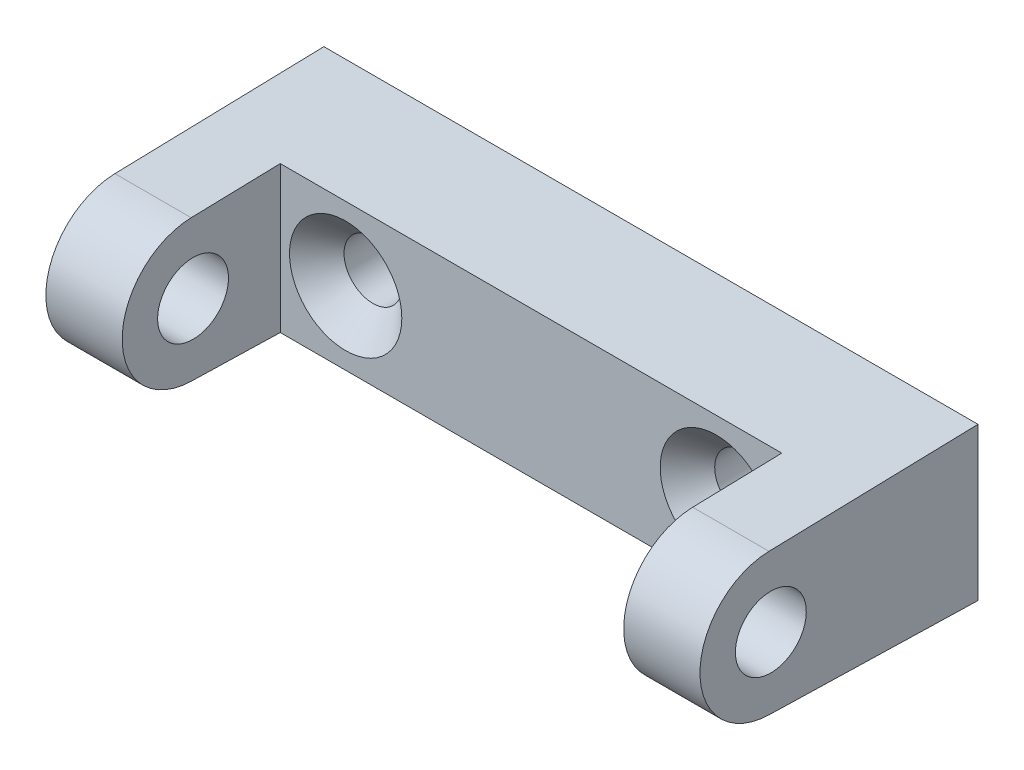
ISO-10303-21;
HEADER;
FILE_DESCRIPTION(('STEP AP214'),'2;1');
FILE_NAME('part.step','',(''),(''),'','','');
FILE_SCHEMA(('AUTOMOTIVE_DESIGN { 1 0 10303 214 1 1 1 1 }'));
ENDSEC;
DATA;
#1=APPLICATION_CONTEXT('core data for automotive mechanical design processes');
#2=APPLICATION_PROTOCOL_DEFINITION('international standard','automotive_design',2000,#1);
#3=PRODUCT_CONTEXT('',#1,'mechanical');
#4=PRODUCT('Part','Part','',(#3));
#5=PRODUCT_RELATED_PRODUCT_CATEGORY('part','',(#4));
#6=PRODUCT_DEFINITION_FORMATION('','',#4);
#7=PRODUCT_DEFINITION_CONTEXT('part definition',#1,'design');
#8=PRODUCT_DEFINITION('design','',#6,#7);
#9=PRODUCT_DEFINITION_SHAPE('','',#8);
#10=(LENGTH_UNIT() NAMED_UNIT(*) SI_UNIT(.MILLI.,.METRE.));
#11=(NAMED_UNIT(*) PLANE_ANGLE_UNIT() SI_UNIT($,.RADIAN.));
#12=(NAMED_UNIT(*) SI_UNIT($,.STERADIAN.) SOLID_ANGLE_UNIT());
#13=UNCERTAINTY_MEASURE_WITH_UNIT(LENGTH_MEASURE(1.E-05),#10,'distance_accuracy_value','');
#14=(GEOMETRIC_REPRESENTATION_CONTEXT(3) GLOBAL_UNCERTAINTY_ASSIGNED_CONTEXT((#13)) GLOBAL_UNIT_ASSIGNED_CONTEXT((#10,
#11,#12)) REPRESENTATION_CONTEXT('',''));
#15=CARTESIAN_POINT('',(0.,0.,0.));
#16=DIRECTION('',(0.,0.,1.));
#17=DIRECTION('',(1.,0.,0.));
#18=AXIS2_PLACEMENT_3D('',#15,#16,#17);
#19=CARTESIAN_POINT('',(34.,0.,18.4953318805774));
#20=DIRECTION('',(0.,0.,-1.));
#21=DIRECTION('',(-1.,0.,0.));
#22=AXIS2_PLACEMENT_3D('',#19,#20,#21);
#23=CYLINDRICAL_SURFACE('',#22,2.65);
#24=CARTESIAN_POINT('',(34.,0.,0.));
#25=DIRECTION('',(0.,0.,-1.));
#26=DIRECTION('',(-1.,0.,0.));
#27=AXIS2_PLACEMENT_3D('',#24,#25,#26);
#28=CIRCLE('',#27,2.65);
#29=CARTESIAN_POINT('',(31.35,0.,0.));
#30=VERTEX_POINT('',#29);
#31=EDGE_CURVE('E104',#30,#30,#28,.T.);
#32=ORIENTED_EDGE('',*,*,#31,.T.);
#33=EDGE_LOOP('',(#32));
#34=FACE_BOUND('',#33,.T.);
#35=CARTESIAN_POINT('',(34.,0.,8.5));
#36=DIRECTION('',(0.,0.,1.));
#37=DIRECTION('',(1.,0.,0.));
#38=AXIS2_PLACEMENT_3D('',#35,#36,#37);
#39=CIRCLE('',#38,2.65);
#40=CARTESIAN_POINT('',(36.65,0.,8.5));
#41=VERTEX_POINT('',#40);
#42=EDGE_CURVE('E337',#41,#41,#39,.T.);
#43=ORIENTED_EDGE('',*,*,#42,.T.);
#44=EDGE_LOOP('',(#43));
#45=FACE_BOUND('',#44,.T.);
#46=ADVANCED_FACE('F14',(#34,#45),#23,.F.);
#47=CARTESIAN_POINT('',(0.,0.,18.4953318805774));
#48=DIRECTION('',(0.,0.,-1.));
#49=DIRECTION('',(-1.,0.,0.));
#50=AXIS2_PLACEMENT_3D('',#47,#48,#49);
#51=CYLINDRICAL_SURFACE('',#50,2.65);
#52=CARTESIAN_POINT('',(0.,0.,0.));
#53=DIRECTION('',(0.,0.,-1.));
#54=DIRECTION('',(-1.,0.,0.));
#55=AXIS2_PLACEMENT_3D('',#52,#53,#54);
#56=CIRCLE('',#55,2.65);
#57=CARTESIAN_POINT('',(-2.65,0.,0.));
#58=VERTEX_POINT('',#57);
#59=EDGE_CURVE('E100',#58,#58,#56,.T.);
#60=ORIENTED_EDGE('',*,*,#59,.T.);
#61=EDGE_LOOP('',(#60));
#62=FACE_BOUND('',#61,.T.);
#63=CARTESIAN_POINT('',(0.,0.,8.5));
#64=DIRECTION('',(0.,0.,1.));
#65=DIRECTION('',(1.,0.,0.));
#66=AXIS2_PLACEMENT_3D('',#63,#64,#65);
#67=CIRCLE('',#66,2.65);
#68=CARTESIAN_POINT('',(2.65,0.,8.5));
#69=VERTEX_POINT('',#68);
#70=EDGE_CURVE('E341',#69,#69,#67,.T.);
#71=ORIENTED_EDGE('',*,*,#70,.T.);
#72=EDGE_LOOP('',(#71));
#73=FACE_BOUND('',#72,.T.);
#74=ADVANCED_FACE('F190',(#62,#73),#51,.F.);
#75=CARTESIAN_POINT('',(47.,0.,19.));
#76=DIRECTION('',(1.,0.,0.));
#77=DIRECTION('',(0.,1.,0.));
#78=AXIS2_PLACEMENT_3D('',#75,#76,#77);
#79=PLANE('',#78);
#80=DIRECTION('',(0.,1.,0.));
#81=VECTOR('',#80,1.);
#82=CARTESIAN_POINT('',(47.,-7.,0.));
#83=LINE('',#82,#81);
#84=CARTESIAN_POINT('',(47.,-7.,0.));
#85=VERTEX_POINT('',#84);
#86=CARTESIAN_POINT('',(47.,7.,0.));
#87=VERTEX_POINT('',#86);
#88=EDGE_CURVE('E141',#85,#87,#83,.T.);
#89=ORIENTED_EDGE('',*,*,#88,.T.);
#90=DIRECTION('',(0.,-0.0261894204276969,0.999656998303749));
#91=VECTOR('',#90,1.);
#92=CARTESIAN_POINT('',(47.,7.,0.));
#93=LINE('',#92,#91);
#94=CARTESIAN_POINT('',(47.,6.49777048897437,19.1702312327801));
#95=VERTEX_POINT('',#94);
#96=EDGE_CURVE('E144',#87,#95,#93,.T.);
#97=ORIENTED_EDGE('',*,*,#96,.T.);
#98=CARTESIAN_POINT('',(47.,0.,19.));
#99=DIRECTION('',(1.,0.,0.));
#100=DIRECTION('',(0.,1.,0.));
#101=AXIS2_PLACEMENT_3D('',#98,#99,#100);
#102=CIRCLE('',#101,6.5);
#103=CARTESIAN_POINT('',(47.,-6.49777048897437,19.1702312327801));
#104=VERTEX_POINT('',#103);
#105=EDGE_CURVE('E147',#95,#104,#102,.T.);
#106=ORIENTED_EDGE('',*,*,#105,.T.);
#107=DIRECTION('',(0.,0.0261894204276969,0.999656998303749));
#108=VECTOR('',#107,1.);
#109=CARTESIAN_POINT('',(47.,-7.,0.));
#110=LINE('',#109,#108);
#111=EDGE_CURVE('E149',#85,#104,#110,.T.);
#112=ORIENTED_EDGE('',*,*,#111,.F.);
#113=EDGE_LOOP('',(#89,#97,#106,#112));
#114=FACE_BOUND('',#113,.T.);
#115=CARTESIAN_POINT('',(47.,0.,19.));
#116=DIRECTION('',(1.,0.,0.));
#117=DIRECTION('',(0.,1.,0.));
#118=AXIS2_PLACEMENT_3D('',#115,#116,#117);
#119=CIRCLE('',#118,3.25);
#120=CARTESIAN_POINT('',(47.,3.25,19.));
#121=VERTEX_POINT('',#120);
#122=EDGE_CURVE('E118',#121,#121,#119,.T.);
#123=ORIENTED_EDGE('',*,*,#122,.F.);
#124=EDGE_LOOP('',(#123));
#125=FACE_BOUND('',#124,.T.);
#126=ADVANCED_FACE('F177',(#114,#125),#79,.T.);
#127=CARTESIAN_POINT('',(-13.,0.,19.));
#128=DIRECTION('',(1.,0.,0.));
#129=DIRECTION('',(0.,1.,0.));
#130=AXIS2_PLACEMENT_3D('',#127,#128,#129);
#131=PLANE('',#130);
#132=DIRECTION('',(0.,1.,0.));
#133=VECTOR('',#132,1.);
#134=CARTESIAN_POINT('',(-13.,-7.,0.));
#135=LINE('',#134,#133);
#136=CARTESIAN_POINT('',(-13.,-7.,0.));
#137=VERTEX_POINT('',#136);
#138=CARTESIAN_POINT('',(-13.,7.,0.));
#139=VERTEX_POINT('',#138);
#140=EDGE_CURVE('E129',#137,#139,#135,.T.);
#141=ORIENTED_EDGE('',*,*,#140,.F.);
#142=DIRECTION('',(0.,0.0261894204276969,0.999656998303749));
#143=VECTOR('',#142,1.);
#144=CARTESIAN_POINT('',(-13.,-7.,0.));
#145=LINE('',#144,#143);
#146=CARTESIAN_POINT('',(-13.,-6.49777048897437,19.1702312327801));
#147=VERTEX_POINT('',#146);
#148=EDGE_CURVE('E138',#137,#147,#145,.T.);
#149=ORIENTED_EDGE('',*,*,#148,.T.);
#150=CARTESIAN_POINT('',(-13.,0.,19.));
#151=DIRECTION('',(1.,0.,0.));
#152=DIRECTION('',(0.,1.,0.));
#153=AXIS2_PLACEMENT_3D('',#150,#151,#152);
#154=CIRCLE('',#153,6.5);
#155=CARTESIAN_POINT('',(-13.,6.49777048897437,19.1702312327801));
#156=VERTEX_POINT('',#155);
#157=EDGE_CURVE('E135',#156,#147,#154,.T.);
#158=ORIENTED_EDGE('',*,*,#157,.F.);
#159=DIRECTION('',(0.,-0.0261894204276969,0.999656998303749));
#160=VECTOR('',#159,1.);
#161=CARTESIAN_POINT('',(-13.,7.,0.));
#162=LINE('',#161,#160);
#163=EDGE_CURVE('E132',#139,#156,#162,.T.);
#164=ORIENTED_EDGE('',*,*,#163,.F.);
#165=EDGE_LOOP('',(#141,#149,#158,#164));
#166=FACE_BOUND('',#165,.T.);
#167=CARTESIAN_POINT('',(-13.,0.,19.));
#168=DIRECTION('',(1.,0.,0.));
#169=DIRECTION('',(0.,1.,0.));
#170=AXIS2_PLACEMENT_3D('',#167,#168,#169);
#171=CIRCLE('',#170,3.25);
#172=CARTESIAN_POINT('',(-13.,3.25,19.));
#173=VERTEX_POINT('',#172);
#174=EDGE_CURVE('E115',#173,#173,#171,.T.);
#175=ORIENTED_EDGE('',*,*,#174,.T.);
#176=EDGE_LOOP('',(#175));
#177=FACE_BOUND('',#176,.T.);
#178=ADVANCED_FACE('F170',(#166,#177),#131,.F.);
#179=CARTESIAN_POINT('',(40.,-7.30930116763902,11.8061061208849));
#180=DIRECTION('',(-1.,0.,0.));
#181=DIRECTION('',(0.,-1.,0.));
#182=AXIS2_PLACEMENT_3D('',#179,#180,#181);
#183=PLANE('',#182);
#184=CARTESIAN_POINT('',(40.,0.,19.));
#185=DIRECTION('',(-1.,0.,0.));
#186=DIRECTION('',(0.,-1.,0.));
#187=AXIS2_PLACEMENT_3D('',#184,#185,#186);
#188=CIRCLE('',#187,6.5);
#189=CARTESIAN_POINT('',(40.,-6.49777048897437,19.1702312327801));
#190=VERTEX_POINT('',#189);
#191=CARTESIAN_POINT('',(40.,6.49777048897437,19.1702312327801));
#192=VERTEX_POINT('',#191);
#193=EDGE_CURVE('E127',#190,#192,#188,.T.);
#194=ORIENTED_EDGE('',*,*,#193,.T.);
#195=DIRECTION('',(0.,-0.0261894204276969,0.999656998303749));
#196=VECTOR('',#195,1.);
#197=CARTESIAN_POINT('',(40.,6.68109643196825,12.1726322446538));
#198=LINE('',#197,#196);
#199=CARTESIAN_POINT('',(40.,6.71181752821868,11.));
#200=VERTEX_POINT('',#199);
#201=EDGE_CURVE('E99',#200,#192,#198,.T.);
#202=ORIENTED_EDGE('',*,*,#201,.F.);
#203=DIRECTION('',(0.,1.,0.));
#204=VECTOR('',#203,1.);
#205=CARTESIAN_POINT('',(40.,-10.,11.));
#206=LINE('',#205,#204);
#207=CARTESIAN_POINT('',(40.,-6.71181752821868,11.));
#208=VERTEX_POINT('',#207);
#209=EDGE_CURVE('E91',#208,#200,#206,.T.);
#210=ORIENTED_EDGE('',*,*,#209,.F.);
#211=DIRECTION('',(0.,-0.0261894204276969,-0.999656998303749));
#212=VECTOR('',#211,1.);
#213=CARTESIAN_POINT('',(40.,-7.,0.));
#214=LINE('',#213,#212);
#215=EDGE_CURVE('E9',#190,#208,#214,.T.);
#216=ORIENTED_EDGE('',*,*,#215,.F.);
#217=EDGE_LOOP('',(#194,#202,#210,#216));
#218=FACE_BOUND('',#217,.T.);
#219=CARTESIAN_POINT('',(40.,0.,19.));
#220=DIRECTION('',(-1.,0.,0.));
#221=DIRECTION('',(0.,-1.,0.));
#222=AXIS2_PLACEMENT_3D('',#219,#220,#221);
#223=CIRCLE('',#222,3.25);
#224=CARTESIAN_POINT('',(40.,-3.25,19.));
#225=VERTEX_POINT('',#224);
#226=EDGE_CURVE('E112',#225,#225,#223,.T.);
#227=ORIENTED_EDGE('',*,*,#226,.F.);
#228=EDGE_LOOP('',(#227));
#229=FACE_BOUND('',#228,.T.);
#230=ADVANCED_FACE('F97',(#218,#229),#183,.T.);
#231=CARTESIAN_POINT('',(-6.,-7.30930116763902,11.8061061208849));
#232=DIRECTION('',(-1.,0.,0.));
#233=DIRECTION('',(0.,-1.,0.));
#234=AXIS2_PLACEMENT_3D('',#231,#232,#233);
#235=PLANE('',#234);
#236=DIRECTION('',(0.,-0.0261894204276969,-0.999656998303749));
#237=VECTOR('',#236,1.);
#238=CARTESIAN_POINT('',(-6.,-7.,0.));
#239=LINE('',#238,#237);
#240=CARTESIAN_POINT('',(-6.,-6.49777048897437,19.1702312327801));
#241=VERTEX_POINT('',#240);
#242=CARTESIAN_POINT('',(-6.,-6.71181752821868,11.));
#243=VERTEX_POINT('',#242);
#244=EDGE_CURVE('E22',#241,#243,#239,.T.);
#245=ORIENTED_EDGE('',*,*,#244,.T.);
#246=DIRECTION('',(0.,1.,0.));
#247=VECTOR('',#246,1.);
#248=CARTESIAN_POINT('',(-6.,-10.,11.));
#249=LINE('',#248,#247);
#250=CARTESIAN_POINT('',(-6.,6.71181752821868,11.));
#251=VERTEX_POINT('',#250);
#252=EDGE_CURVE('E94',#243,#251,#249,.T.);
#253=ORIENTED_EDGE('',*,*,#252,.T.);
#254=DIRECTION('',(0.,-0.0261894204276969,0.999656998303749));
#255=VECTOR('',#254,1.);
#256=CARTESIAN_POINT('',(-6.,6.68109643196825,12.1726322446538));
#257=LINE('',#256,#255);
#258=CARTESIAN_POINT('',(-6.,6.49777048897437,19.1702312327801));
#259=VERTEX_POINT('',#258);
#260=EDGE_CURVE('E122',#251,#259,#257,.T.);
#261=ORIENTED_EDGE('',*,*,#260,.T.);
#262=CARTESIAN_POINT('',(-6.,0.,19.));
#263=DIRECTION('',(-1.,0.,0.));
#264=DIRECTION('',(0.,-1.,0.));
#265=AXIS2_PLACEMENT_3D('',#262,#263,#264);
#266=CIRCLE('',#265,6.5);
#267=EDGE_CURVE('E124',#241,#259,#266,.T.);
#268=ORIENTED_EDGE('',*,*,#267,.F.);
#269=EDGE_LOOP('',(#245,#253,#261,#268));
#270=FACE_BOUND('',#269,.T.);
#271=CARTESIAN_POINT('',(-6.,0.,19.));
#272=DIRECTION('',(-1.,0.,0.));
#273=DIRECTION('',(0.,-1.,0.));
#274=AXIS2_PLACEMENT_3D('',#271,#272,#273);
#275=CIRCLE('',#274,3.25);
#276=CARTESIAN_POINT('',(-6.,-3.25,19.));
#277=VERTEX_POINT('',#276);
#278=EDGE_CURVE('E109',#277,#277,#275,.T.);
#279=ORIENTED_EDGE('',*,*,#278,.T.);
#280=EDGE_LOOP('',(#279));
#281=FACE_BOUND('',#280,.T.);
#282=ADVANCED_FACE('F160',(#270,#281),#235,.F.);
#283=CARTESIAN_POINT('',(47.,7.,0.));
#284=DIRECTION('',(0.,-0.999656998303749,-0.0261894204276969));
#285=DIRECTION('',(0.,0.0261894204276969,-0.999656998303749));
#286=AXIS2_PLACEMENT_3D('',#283,#284,#285);
#287=PLANE('',#286);
#288=ORIENTED_EDGE('',*,*,#260,.F.);
#289=DIRECTION('',(1.,0.,0.));
#290=VECTOR('',#289,1.);
#291=CARTESIAN_POINT('',(47.,6.71181752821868,11.));
#292=LINE('',#291,#290);
#293=EDGE_CURVE('E95',#251,#200,#292,.T.);
#294=ORIENTED_EDGE('',*,*,#293,.T.);
#295=ORIENTED_EDGE('',*,*,#201,.T.);
#296=DIRECTION('',(-1.,0.,0.));
#297=VECTOR('',#296,1.);
#298=CARTESIAN_POINT('',(47.,6.49777048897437,19.1702312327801));
#299=LINE('',#298,#297);
#300=EDGE_CURVE('E155',#95,#192,#299,.T.);
#301=ORIENTED_EDGE('',*,*,#300,.F.);
#302=ORIENTED_EDGE('',*,*,#96,.F.);
#303=DIRECTION('',(-1.,0.,0.));
#304=VECTOR('',#303,1.);
#305=CARTESIAN_POINT('',(47.,7.,0.));
#306=LINE('',#305,#304);
#307=EDGE_CURVE('E158',#87,#139,#306,.T.);
#308=ORIENTED_EDGE('',*,*,#307,.T.);
#309=ORIENTED_EDGE('',*,*,#163,.T.);
#310=EDGE_CURVE('E154',#259,#156,#299,.T.);
#311=ORIENTED_EDGE('',*,*,#310,.F.);
#312=EDGE_LOOP('',(#288,#294,#295,#301,#302,#308,#309,#311));
#313=FACE_BOUND('',#312,.T.);
#314=ADVANCED_FACE('F16',(#313),#287,.F.);
#315=CARTESIAN_POINT('',(47.,0.,19.));
#316=DIRECTION('',(-1.,0.,0.));
#317=DIRECTION('',(0.,-1.,0.));
#318=AXIS2_PLACEMENT_3D('',#315,#316,#317);
#319=CYLINDRICAL_SURFACE('',#318,6.5);
#320=ORIENTED_EDGE('',*,*,#193,.F.);
#321=DIRECTION('',(-1.,0.,0.));
#322=VECTOR('',#321,1.);
#323=CARTESIAN_POINT('',(47.,-6.49777048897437,19.1702312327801));
#324=LINE('',#323,#322);
#325=EDGE_CURVE('E37',#104,#190,#324,.T.);
#326=ORIENTED_EDGE('',*,*,#325,.F.);
#327=ORIENTED_EDGE('',*,*,#105,.F.);
#328=ORIENTED_EDGE('',*,*,#300,.T.);
#329=EDGE_LOOP('',(#320,#326,#327,#328));
#330=FACE_BOUND('',#329,.T.);
#331=ADVANCED_FACE('F179',(#330),#319,.T.);
#332=CARTESIAN_POINT('',(47.,-7.,0.));
#333=DIRECTION('',(0.,-0.999656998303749,0.0261894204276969));
#334=DIRECTION('',(0.,-0.0261894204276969,-0.999656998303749));
#335=AXIS2_PLACEMENT_3D('',#332,#333,#334);
#336=PLANE('',#335);
#337=DIRECTION('',(1.,0.,0.));
#338=VECTOR('',#337,1.);
#339=CARTESIAN_POINT('',(47.,-6.71181752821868,11.));
#340=LINE('',#339,#338);
#341=EDGE_CURVE('E82',#243,#208,#340,.T.);
#342=ORIENTED_EDGE('',*,*,#341,.F.);
#343=ORIENTED_EDGE('',*,*,#244,.F.);
#344=EDGE_CURVE('E152',#241,#147,#324,.T.);
#345=ORIENTED_EDGE('',*,*,#344,.T.);
#346=ORIENTED_EDGE('',*,*,#148,.F.);
#347=DIRECTION('',(-1.,0.,0.));
#348=VECTOR('',#347,1.);
#349=CARTESIAN_POINT('',(47.,-7.,0.));
#350=LINE('',#349,#348);
#351=EDGE_CURVE('E29',#85,#137,#350,.T.);
#352=ORIENTED_EDGE('',*,*,#351,.F.);
#353=ORIENTED_EDGE('',*,*,#111,.T.);
#354=ORIENTED_EDGE('',*,*,#325,.T.);
#355=ORIENTED_EDGE('',*,*,#215,.T.);
#356=EDGE_LOOP('',(#342,#343,#345,#346,#352,#353,#354,#355));
#357=FACE_BOUND('',#356,.T.);
#358=ADVANCED_FACE('F80',(#357),#336,.T.);
#359=CARTESIAN_POINT('',(47.,-7.,0.));
#360=DIRECTION('',(0.,0.,1.));
#361=DIRECTION('',(1.,0.,0.));
#362=AXIS2_PLACEMENT_3D('',#359,#360,#361);
#363=PLANE('',#362);
#364=ORIENTED_EDGE('',*,*,#59,.F.);
#365=EDGE_LOOP('',(#364));
#366=FACE_BOUND('',#365,.T.);
#367=ORIENTED_EDGE('',*,*,#31,.F.);
#368=EDGE_LOOP('',(#367));
#369=FACE_BOUND('',#368,.T.);
#370=ORIENTED_EDGE('',*,*,#307,.F.);
#371=ORIENTED_EDGE('',*,*,#88,.F.);
#372=ORIENTED_EDGE('',*,*,#351,.T.);
#373=ORIENTED_EDGE('',*,*,#140,.T.);
#374=EDGE_LOOP('',(#370,#371,#372,#373));
#375=FACE_BOUND('',#374,.T.);
#376=ADVANCED_FACE('F173',(#366,#369,#375),#363,.F.);
#377=ORIENTED_EDGE('',*,*,#267,.T.);
#378=ORIENTED_EDGE('',*,*,#310,.T.);
#379=ORIENTED_EDGE('',*,*,#157,.T.);
#380=ORIENTED_EDGE('',*,*,#344,.F.);
#381=EDGE_LOOP('',(#377,#378,#379,#380));
#382=FACE_BOUND('',#381,.T.);
#383=ADVANCED_FACE('F164',(#382),#319,.T.);
#384=CARTESIAN_POINT('',(-17.75,0.,19.));
#385=DIRECTION('',(1.,0.,0.));
#386=DIRECTION('',(0.,1.,0.));
#387=AXIS2_PLACEMENT_3D('',#384,#385,#386);
#388=CYLINDRICAL_SURFACE('',#387,3.25);
#389=ORIENTED_EDGE('',*,*,#278,.F.);
#390=EDGE_LOOP('',(#389));
#391=FACE_BOUND('',#390,.T.);
#392=ORIENTED_EDGE('',*,*,#174,.F.);
#393=EDGE_LOOP('',(#392));
#394=FACE_BOUND('',#393,.T.);
#395=ADVANCED_FACE('F210',(#391,#394),#388,.F.);
#396=ORIENTED_EDGE('',*,*,#122,.T.);
#397=EDGE_LOOP('',(#396));
#398=FACE_BOUND('',#397,.T.);
#399=ORIENTED_EDGE('',*,*,#226,.T.);
#400=EDGE_LOOP('',(#399));
#401=FACE_BOUND('',#400,.T.);
#402=ADVANCED_FACE('F206',(#398,#401),#388,.F.);
#403=CARTESIAN_POINT('',(-6.,-10.,11.));
#404=DIRECTION('',(0.,0.,-1.));
#405=DIRECTION('',(-1.,0.,0.));
#406=AXIS2_PLACEMENT_3D('',#403,#404,#405);
#407=PLANE('',#406);
#408=CARTESIAN_POINT('',(34.,0.,11.));
#409=DIRECTION('',(0.,0.,1.));
#410=DIRECTION('',(1.,0.,0.));
#411=AXIS2_PLACEMENT_3D('',#408,#409,#410);
#412=CIRCLE('',#411,5.15);
#413=CARTESIAN_POINT('',(39.15,0.,11.));
#414=VERTEX_POINT('',#413);
#415=EDGE_CURVE('E334',#414,#414,#412,.T.);
#416=ORIENTED_EDGE('',*,*,#415,.F.);
#417=EDGE_LOOP('',(#416));
#418=FACE_BOUND('',#417,.T.);
#419=CARTESIAN_POINT('',(0.,0.,11.));
#420=DIRECTION('',(0.,0.,1.));
#421=DIRECTION('',(1.,0.,0.));
#422=AXIS2_PLACEMENT_3D('',#419,#420,#421);
#423=CIRCLE('',#422,5.15);
#424=CARTESIAN_POINT('',(5.15,0.,11.));
#425=VERTEX_POINT('',#424);
#426=EDGE_CURVE('E338',#425,#425,#423,.T.);
#427=ORIENTED_EDGE('',*,*,#426,.F.);
#428=EDGE_LOOP('',(#427));
#429=FACE_BOUND('',#428,.T.);
#430=ORIENTED_EDGE('',*,*,#252,.F.);
#431=ORIENTED_EDGE('',*,*,#341,.T.);
#432=ORIENTED_EDGE('',*,*,#209,.T.);
#433=ORIENTED_EDGE('',*,*,#293,.F.);
#434=EDGE_LOOP('',(#430,#431,#432,#433));
#435=FACE_BOUND('',#434,.T.);
#436=ADVANCED_FACE('F89',(#418,#429,#435),#407,.F.);
#437=CARTESIAN_POINT('',(0.,0.,8.5));
#438=DIRECTION('',(0.,0.,1.));
#439=DIRECTION('',(1.,0.,0.));
#440=AXIS2_PLACEMENT_3D('',#437,#438,#439);
#441=CONICAL_SURFACE('',#440,2.65,0.785398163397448);
#442=ORIENTED_EDGE('',*,*,#426,.T.);
#443=EDGE_LOOP('',(#442));
#444=FACE_BOUND('',#443,.T.);
#445=ORIENTED_EDGE('',*,*,#70,.F.);
#446=EDGE_LOOP('',(#445));
#447=FACE_BOUND('',#446,.T.);
#448=ADVANCED_FACE('F205',(#444,#447),#441,.F.);
#449=CARTESIAN_POINT('',(34.,0.,8.5));
#450=DIRECTION('',(0.,0.,1.));
#451=DIRECTION('',(1.,0.,0.));
#452=AXIS2_PLACEMENT_3D('',#449,#450,#451);
#453=CONICAL_SURFACE('',#452,2.65,0.785398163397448);
#454=ORIENTED_EDGE('',*,*,#415,.T.);
#455=EDGE_LOOP('',(#454));
#456=FACE_BOUND('',#455,.T.);
#457=ORIENTED_EDGE('',*,*,#42,.F.);
#458=EDGE_LOOP('',(#457));
#459=FACE_BOUND('',#458,.T.);
#460=ADVANCED_FACE('F256',(#456,#459),#453,.F.);
#461=CLOSED_SHELL('',(#46,#74,#126,#178,#230,#282,#314,#331,#358,#376,#383,#395,#402,#436,#448,#460));
#462=MANIFOLD_SOLID_BREP('B1',#461);
#463=ADVANCED_BREP_SHAPE_REPRESENTATION('',(#18,#462),#14);
#464=SHAPE_DEFINITION_REPRESENTATION(#9,#463);
ENDSEC;
END-ISO-10303-21;
